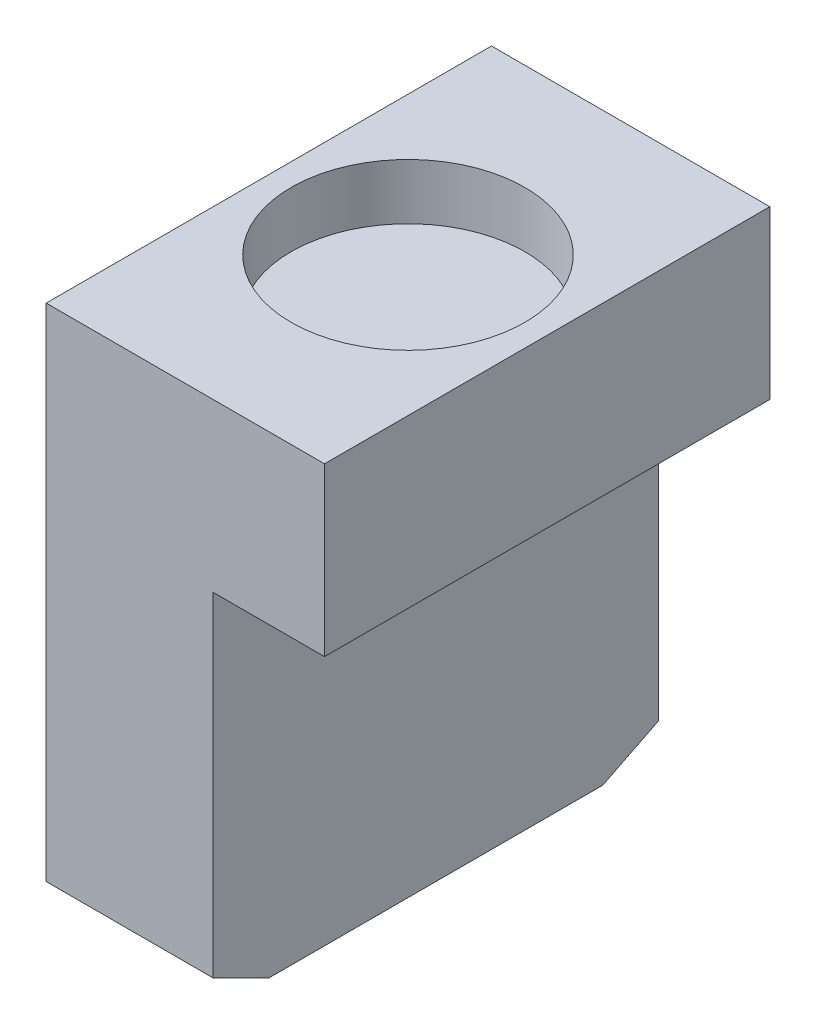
ISO-10303-21;
HEADER;
FILE_DESCRIPTION(('STEP AP214'),'2;1');
FILE_NAME('part.step','',(''),(''),'','','');
FILE_SCHEMA(('AUTOMOTIVE_DESIGN { 1 0 10303 214 1 1 1 1 }'));
ENDSEC;
DATA;
#1=APPLICATION_CONTEXT('core data for automotive mechanical design processes');
#2=APPLICATION_PROTOCOL_DEFINITION('international standard','automotive_design',2000,#1);
#3=PRODUCT_CONTEXT('',#1,'mechanical');
#4=PRODUCT('Part','Part','',(#3));
#5=PRODUCT_RELATED_PRODUCT_CATEGORY('part','',(#4));
#6=PRODUCT_DEFINITION_FORMATION('','',#4);
#7=PRODUCT_DEFINITION_CONTEXT('part definition',#1,'design');
#8=PRODUCT_DEFINITION('design','',#6,#7);
#9=PRODUCT_DEFINITION_SHAPE('','',#8);
#10=(LENGTH_UNIT() NAMED_UNIT(*) SI_UNIT(.MILLI.,.METRE.));
#11=(NAMED_UNIT(*) PLANE_ANGLE_UNIT() SI_UNIT($,.RADIAN.));
#12=(NAMED_UNIT(*) SI_UNIT($,.STERADIAN.) SOLID_ANGLE_UNIT());
#13=UNCERTAINTY_MEASURE_WITH_UNIT(LENGTH_MEASURE(1.E-05),#10,'distance_accuracy_value','');
#14=(GEOMETRIC_REPRESENTATION_CONTEXT(3) GLOBAL_UNCERTAINTY_ASSIGNED_CONTEXT((#13)) GLOBAL_UNIT_ASSIGNED_CONTEXT((#10,
#11,#12)) REPRESENTATION_CONTEXT('',''));
#15=CARTESIAN_POINT('',(0.,0.,0.));
#16=DIRECTION('',(0.,0.,1.));
#17=DIRECTION('',(1.,0.,0.));
#18=AXIS2_PLACEMENT_3D('',#15,#16,#17);
#19=CARTESIAN_POINT('',(0.,0.,8.));
#20=DIRECTION('',(0.,1.,0.));
#21=DIRECTION('',(0.,0.,1.));
#22=AXIS2_PLACEMENT_3D('',#19,#20,#21);
#23=PLANE('',#22);
#24=DIRECTION('',(1.,0.,0.));
#25=VECTOR('',#24,1.);
#26=CARTESIAN_POINT('',(0.,0.,6.99999999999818));
#27=LINE('',#26,#25);
#28=CARTESIAN_POINT('',(0.,0.,6.99999999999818));
#29=VERTEX_POINT('',#28);
#30=CARTESIAN_POINT('',(3.,0.,6.99999999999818));
#31=VERTEX_POINT('',#30);
#32=EDGE_CURVE('E98',#29,#31,#27,.T.);
#33=ORIENTED_EDGE('',*,*,#32,.F.);
#34=DIRECTION('',(0.,0.,-1.));
#35=VECTOR('',#34,1.);
#36=CARTESIAN_POINT('',(0.,0.,8.));
#37=LINE('',#36,#35);
#38=CARTESIAN_POINT('',(0.,-1.14089293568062E-13,0.999999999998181));
#39=VERTEX_POINT('',#38);
#40=EDGE_CURVE('E110',#29,#39,#37,.T.);
#41=ORIENTED_EDGE('',*,*,#40,.T.);
#42=DIRECTION('',(1.,0.,0.));
#43=VECTOR('',#42,1.);
#44=CARTESIAN_POINT('',(0.,-1.13686837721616E-13,0.999999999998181));
#45=LINE('',#44,#43);
#46=CARTESIAN_POINT('',(3.,-1.13686837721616E-13,0.999999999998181));
#47=VERTEX_POINT('',#46);
#48=EDGE_CURVE('E111',#39,#47,#45,.T.);
#49=ORIENTED_EDGE('',*,*,#48,.T.);
#50=DIRECTION('',(0.,0.,-1.));
#51=VECTOR('',#50,1.);
#52=CARTESIAN_POINT('',(3.,0.,8.));
#53=LINE('',#52,#51);
#54=EDGE_CURVE('E12',#31,#47,#53,.T.);
#55=ORIENTED_EDGE('',*,*,#54,.F.);
#56=EDGE_LOOP('',(#33,#41,#49,#55));
#57=FACE_BOUND('',#56,.T.);
#58=ADVANCED_FACE('F33',(#57),#23,.F.);
#59=CARTESIAN_POINT('',(3.,0.,8.));
#60=DIRECTION('',(-1.,0.,0.));
#61=DIRECTION('',(0.,0.,1.));
#62=AXIS2_PLACEMENT_3D('',#59,#60,#61);
#63=PLANE('',#62);
#64=DIRECTION('',(0.,-0.447213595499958,-0.894427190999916));
#65=VECTOR('',#64,1.);
#66=CARTESIAN_POINT('',(3.,0.,6.99999999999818));
#67=LINE('',#66,#65);
#68=CARTESIAN_POINT('',(3.,0.50000000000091,8.));
#69=VERTEX_POINT('',#68);
#70=EDGE_CURVE('E47',#69,#31,#67,.T.);
#71=ORIENTED_EDGE('',*,*,#70,.T.);
#72=ORIENTED_EDGE('',*,*,#54,.T.);
#73=DIRECTION('',(0.,0.447213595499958,-0.894427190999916));
#74=VECTOR('',#73,1.);
#75=CARTESIAN_POINT('',(3.,-1.13686837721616E-13,0.999999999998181));
#76=LINE('',#75,#74);
#77=CARTESIAN_POINT('',(3.,0.499999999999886,-1.81898940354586E-12));
#78=VERTEX_POINT('',#77);
#79=EDGE_CURVE('E104',#47,#78,#76,.T.);
#80=ORIENTED_EDGE('',*,*,#79,.T.);
#81=DIRECTION('',(0.,1.,0.));
#82=VECTOR('',#81,1.);
#83=CARTESIAN_POINT('',(3.,0.,0.));
#84=LINE('',#83,#82);
#85=CARTESIAN_POINT('',(3.,6.5,0.));
#86=VERTEX_POINT('',#85);
#87=EDGE_CURVE('E146',#78,#86,#84,.T.);
#88=ORIENTED_EDGE('',*,*,#87,.T.);
#89=DIRECTION('',(0.,0.,-1.));
#90=VECTOR('',#89,1.);
#91=CARTESIAN_POINT('',(3.,6.5,8.));
#92=LINE('',#91,#90);
#93=CARTESIAN_POINT('',(3.,6.5,8.));
#94=VERTEX_POINT('',#93);
#95=EDGE_CURVE('E40',#94,#86,#92,.T.);
#96=ORIENTED_EDGE('',*,*,#95,.F.);
#97=DIRECTION('',(0.,1.,0.));
#98=VECTOR('',#97,1.);
#99=CARTESIAN_POINT('',(3.,0.,8.));
#100=LINE('',#99,#98);
#101=EDGE_CURVE('E156',#69,#94,#100,.T.);
#102=ORIENTED_EDGE('',*,*,#101,.F.);
#103=EDGE_LOOP('',(#71,#72,#80,#88,#96,#102));
#104=FACE_BOUND('',#103,.T.);
#105=ADVANCED_FACE('F200',(#104),#63,.F.);
#106=CARTESIAN_POINT('',(0.,0.,8.));
#107=DIRECTION('',(1.,0.,0.));
#108=DIRECTION('',(0.,0.,-1.));
#109=AXIS2_PLACEMENT_3D('',#106,#107,#108);
#110=PLANE('',#109);
#111=DIRECTION('',(0.,-0.447213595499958,-0.894427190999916));
#112=VECTOR('',#111,1.);
#113=CARTESIAN_POINT('',(0.,0.,6.99999999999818));
#114=LINE('',#113,#112);
#115=CARTESIAN_POINT('',(0.,0.5,7.99999999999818));
#116=VERTEX_POINT('',#115);
#117=EDGE_CURVE('E95',#116,#29,#114,.T.);
#118=ORIENTED_EDGE('',*,*,#117,.F.);
#119=DIRECTION('',(0.,-1.,0.));
#120=VECTOR('',#119,1.);
#121=CARTESIAN_POINT('',(0.,0.,8.));
#122=LINE('',#121,#120);
#123=CARTESIAN_POINT('',(0.,9.5,8.));
#124=VERTEX_POINT('',#123);
#125=EDGE_CURVE('E116',#124,#116,#122,.T.);
#126=ORIENTED_EDGE('',*,*,#125,.F.);
#127=DIRECTION('',(0.,0.,-1.));
#128=VECTOR('',#127,1.);
#129=CARTESIAN_POINT('',(0.,9.5,8.));
#130=LINE('',#129,#128);
#131=CARTESIAN_POINT('',(0.,9.5,0.));
#132=VERTEX_POINT('',#131);
#133=EDGE_CURVE('E115',#124,#132,#130,.T.);
#134=ORIENTED_EDGE('',*,*,#133,.T.);
#135=DIRECTION('',(0.,-1.,0.));
#136=VECTOR('',#135,1.);
#137=CARTESIAN_POINT('',(0.,0.,0.));
#138=LINE('',#137,#136);
#139=CARTESIAN_POINT('',(0.,0.499999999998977,0.));
#140=VERTEX_POINT('',#139);
#141=EDGE_CURVE('E124',#132,#140,#138,.T.);
#142=ORIENTED_EDGE('',*,*,#141,.T.);
#143=DIRECTION('',(0.,0.447213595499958,-0.894427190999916));
#144=VECTOR('',#143,1.);
#145=CARTESIAN_POINT('',(0.,-1.13686837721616E-13,0.999999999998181));
#146=LINE('',#145,#144);
#147=EDGE_CURVE('E55',#39,#140,#146,.T.);
#148=ORIENTED_EDGE('',*,*,#147,.F.);
#149=ORIENTED_EDGE('',*,*,#40,.F.);
#150=EDGE_LOOP('',(#118,#126,#134,#142,#148,#149));
#151=FACE_BOUND('',#150,.T.);
#152=ADVANCED_FACE('F113',(#151),#110,.F.);
#153=CARTESIAN_POINT('',(3.,0.,8.));
#154=DIRECTION('',(0.,0.,1.));
#155=DIRECTION('',(1.,0.,0.));
#156=AXIS2_PLACEMENT_3D('',#153,#154,#155);
#157=PLANE('',#156);
#158=DIRECTION('',(-1.,0.,0.));
#159=VECTOR('',#158,1.);
#160=CARTESIAN_POINT('',(0.,9.5,8.));
#161=LINE('',#160,#159);
#162=CARTESIAN_POINT('',(5.,9.5,8.));
#163=VERTEX_POINT('',#162);
#164=EDGE_CURVE('E121',#163,#124,#161,.T.);
#165=ORIENTED_EDGE('',*,*,#164,.T.);
#166=ORIENTED_EDGE('',*,*,#125,.T.);
#167=DIRECTION('',(1.,0.,0.));
#168=VECTOR('',#167,1.);
#169=CARTESIAN_POINT('',(0.,0.5,7.99999999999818));
#170=LINE('',#169,#168);
#171=EDGE_CURVE('E99',#116,#69,#170,.T.);
#172=ORIENTED_EDGE('',*,*,#171,.T.);
#173=ORIENTED_EDGE('',*,*,#101,.T.);
#174=DIRECTION('',(1.,0.,0.));
#175=VECTOR('',#174,1.);
#176=CARTESIAN_POINT('',(3.,6.5,8.));
#177=LINE('',#176,#175);
#178=CARTESIAN_POINT('',(5.,6.5,8.));
#179=VERTEX_POINT('',#178);
#180=EDGE_CURVE('E139',#94,#179,#177,.T.);
#181=ORIENTED_EDGE('',*,*,#180,.T.);
#182=DIRECTION('',(0.,1.,0.));
#183=VECTOR('',#182,1.);
#184=CARTESIAN_POINT('',(5.,6.5,8.));
#185=LINE('',#184,#183);
#186=EDGE_CURVE('E160',#179,#163,#185,.T.);
#187=ORIENTED_EDGE('',*,*,#186,.T.);
#188=EDGE_LOOP('',(#165,#166,#172,#173,#181,#187));
#189=FACE_BOUND('',#188,.T.);
#190=ADVANCED_FACE('F168',(#189),#157,.T.);
#191=CARTESIAN_POINT('',(3.,0.,0.));
#192=DIRECTION('',(0.,0.,1.));
#193=DIRECTION('',(1.,0.,0.));
#194=AXIS2_PLACEMENT_3D('',#191,#192,#193);
#195=PLANE('',#194);
#196=DIRECTION('',(1.,0.,0.));
#197=VECTOR('',#196,1.);
#198=CARTESIAN_POINT('',(3.,6.5,0.));
#199=LINE('',#198,#197);
#200=CARTESIAN_POINT('',(5.,6.5,0.));
#201=VERTEX_POINT('',#200);
#202=EDGE_CURVE('E138',#86,#201,#199,.T.);
#203=ORIENTED_EDGE('',*,*,#202,.F.);
#204=ORIENTED_EDGE('',*,*,#87,.F.);
#205=DIRECTION('',(1.,0.,0.));
#206=VECTOR('',#205,1.);
#207=CARTESIAN_POINT('',(0.,0.499999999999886,-1.81898940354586E-12));
#208=LINE('',#207,#206);
#209=EDGE_CURVE('E172',#140,#78,#208,.T.);
#210=ORIENTED_EDGE('',*,*,#209,.F.);
#211=ORIENTED_EDGE('',*,*,#141,.F.);
#212=DIRECTION('',(-1.,0.,0.));
#213=VECTOR('',#212,1.);
#214=CARTESIAN_POINT('',(0.,9.5,0.));
#215=LINE('',#214,#213);
#216=CARTESIAN_POINT('',(5.,9.5,0.));
#217=VERTEX_POINT('',#216);
#218=EDGE_CURVE('E150',#217,#132,#215,.T.);
#219=ORIENTED_EDGE('',*,*,#218,.F.);
#220=DIRECTION('',(0.,1.,0.));
#221=VECTOR('',#220,1.);
#222=CARTESIAN_POINT('',(5.,6.5,0.));
#223=LINE('',#222,#221);
#224=EDGE_CURVE('E148',#201,#217,#223,.T.);
#225=ORIENTED_EDGE('',*,*,#224,.F.);
#226=EDGE_LOOP('',(#203,#204,#210,#211,#219,#225));
#227=FACE_BOUND('',#226,.T.);
#228=ADVANCED_FACE('F145',(#227),#195,.F.);
#229=CARTESIAN_POINT('',(3.,6.5,8.));
#230=DIRECTION('',(0.,1.,0.));
#231=DIRECTION('',(0.,0.,1.));
#232=AXIS2_PLACEMENT_3D('',#229,#230,#231);
#233=PLANE('',#232);
#234=ORIENTED_EDGE('',*,*,#202,.T.);
#235=DIRECTION('',(0.,0.,-1.));
#236=VECTOR('',#235,1.);
#237=CARTESIAN_POINT('',(5.,6.5,8.));
#238=LINE('',#237,#236);
#239=EDGE_CURVE('E129',#179,#201,#238,.T.);
#240=ORIENTED_EDGE('',*,*,#239,.F.);
#241=ORIENTED_EDGE('',*,*,#180,.F.);
#242=ORIENTED_EDGE('',*,*,#95,.T.);
#243=EDGE_LOOP('',(#234,#240,#241,#242));
#244=FACE_BOUND('',#243,.T.);
#245=ADVANCED_FACE('F136',(#244),#233,.F.);
#246=CARTESIAN_POINT('',(5.,6.5,8.));
#247=DIRECTION('',(-1.,0.,0.));
#248=DIRECTION('',(0.,0.,1.));
#249=AXIS2_PLACEMENT_3D('',#246,#247,#248);
#250=PLANE('',#249);
#251=ORIENTED_EDGE('',*,*,#224,.T.);
#252=DIRECTION('',(0.,0.,-1.));
#253=VECTOR('',#252,1.);
#254=CARTESIAN_POINT('',(5.,9.5,8.));
#255=LINE('',#254,#253);
#256=EDGE_CURVE('E119',#163,#217,#255,.T.);
#257=ORIENTED_EDGE('',*,*,#256,.F.);
#258=ORIENTED_EDGE('',*,*,#186,.F.);
#259=ORIENTED_EDGE('',*,*,#239,.T.);
#260=EDGE_LOOP('',(#251,#257,#258,#259));
#261=FACE_BOUND('',#260,.T.);
#262=ADVANCED_FACE('F187',(#261),#250,.F.);
#263=CARTESIAN_POINT('',(0.,9.5,8.));
#264=DIRECTION('',(0.,-1.,0.));
#265=DIRECTION('',(0.,0.,-1.));
#266=AXIS2_PLACEMENT_3D('',#263,#264,#265);
#267=PLANE('',#266);
#268=CARTESIAN_POINT('',(2.5,9.5,4.));
#269=DIRECTION('',(0.,1.,0.));
#270=DIRECTION('',(0.,0.,1.));
#271=AXIS2_PLACEMENT_3D('',#268,#269,#270);
#272=CIRCLE('',#271,2.1);
#273=CARTESIAN_POINT('',(2.5,9.5,6.1));
#274=VERTEX_POINT('',#273);
#275=EDGE_CURVE('E163',#274,#274,#272,.T.);
#276=ORIENTED_EDGE('',*,*,#275,.F.);
#277=EDGE_LOOP('',(#276));
#278=FACE_BOUND('',#277,.T.);
#279=ORIENTED_EDGE('',*,*,#218,.T.);
#280=ORIENTED_EDGE('',*,*,#133,.F.);
#281=ORIENTED_EDGE('',*,*,#164,.F.);
#282=ORIENTED_EDGE('',*,*,#256,.T.);
#283=EDGE_LOOP('',(#279,#280,#281,#282));
#284=FACE_BOUND('',#283,.T.);
#285=ADVANCED_FACE('F171',(#278,#284),#267,.F.);
#286=CARTESIAN_POINT('',(2.5,8.5,4.));
#287=DIRECTION('',(0.,1.,0.));
#288=DIRECTION('',(0.,0.,1.));
#289=AXIS2_PLACEMENT_3D('',#286,#287,#288);
#290=CYLINDRICAL_SURFACE('',#289,2.1);
#291=CARTESIAN_POINT('',(2.5,8.5,4.));
#292=DIRECTION('',(0.,1.,0.));
#293=DIRECTION('',(0.,0.,1.));
#294=AXIS2_PLACEMENT_3D('',#291,#292,#293);
#295=CIRCLE('',#294,2.1);
#296=CARTESIAN_POINT('',(2.5,8.5,6.1));
#297=VERTEX_POINT('',#296);
#298=EDGE_CURVE('E152',#297,#297,#295,.T.);
#299=ORIENTED_EDGE('',*,*,#298,.F.);
#300=EDGE_LOOP('',(#299));
#301=FACE_BOUND('',#300,.T.);
#302=ORIENTED_EDGE('',*,*,#275,.T.);
#303=EDGE_LOOP('',(#302));
#304=FACE_BOUND('',#303,.T.);
#305=ADVANCED_FACE('F184',(#301,#304),#290,.F.);
#306=CARTESIAN_POINT('',(2.5,8.5,4.));
#307=DIRECTION('',(0.,1.,0.));
#308=DIRECTION('',(0.,0.,1.));
#309=AXIS2_PLACEMENT_3D('',#306,#307,#308);
#310=PLANE('',#309);
#311=ORIENTED_EDGE('',*,*,#298,.T.);
#312=EDGE_LOOP('',(#311));
#313=FACE_BOUND('',#312,.T.);
#314=ADVANCED_FACE('F193',(#313),#310,.T.);
#315=CARTESIAN_POINT('',(0.,-1.13686837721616E-13,0.999999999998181));
#316=DIRECTION('',(0.,-0.894427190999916,-0.447213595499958));
#317=DIRECTION('',(0.,0.447213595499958,-0.894427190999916));
#318=AXIS2_PLACEMENT_3D('',#315,#316,#317);
#319=PLANE('',#318);
#320=ORIENTED_EDGE('',*,*,#79,.F.);
#321=ORIENTED_EDGE('',*,*,#48,.F.);
#322=ORIENTED_EDGE('',*,*,#147,.T.);
#323=ORIENTED_EDGE('',*,*,#209,.T.);
#324=EDGE_LOOP('',(#320,#321,#322,#323));
#325=FACE_BOUND('',#324,.T.);
#326=ADVANCED_FACE('F220',(#325),#319,.T.);
#327=CARTESIAN_POINT('',(0.,0.,6.99999999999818));
#328=DIRECTION('',(0.,-0.894427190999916,0.447213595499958));
#329=DIRECTION('',(0.,-0.447213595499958,-0.894427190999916));
#330=AXIS2_PLACEMENT_3D('',#327,#328,#329);
#331=PLANE('',#330);
#332=ORIENTED_EDGE('',*,*,#70,.F.);
#333=ORIENTED_EDGE('',*,*,#171,.F.);
#334=ORIENTED_EDGE('',*,*,#117,.T.);
#335=ORIENTED_EDGE('',*,*,#32,.T.);
#336=EDGE_LOOP('',(#332,#333,#334,#335));
#337=FACE_BOUND('',#336,.T.);
#338=ADVANCED_FACE('F97',(#337),#331,.T.);
#339=CLOSED_SHELL('',(#58,#105,#152,#190,#228,#245,#262,#285,#305,#314,#326,#338));
#340=MANIFOLD_SOLID_BREP('B2',#339);
#341=ADVANCED_BREP_SHAPE_REPRESENTATION('',(#18,#340),#14);
#342=SHAPE_DEFINITION_REPRESENTATION(#9,#341);
ENDSEC;
END-ISO-10303-21;
